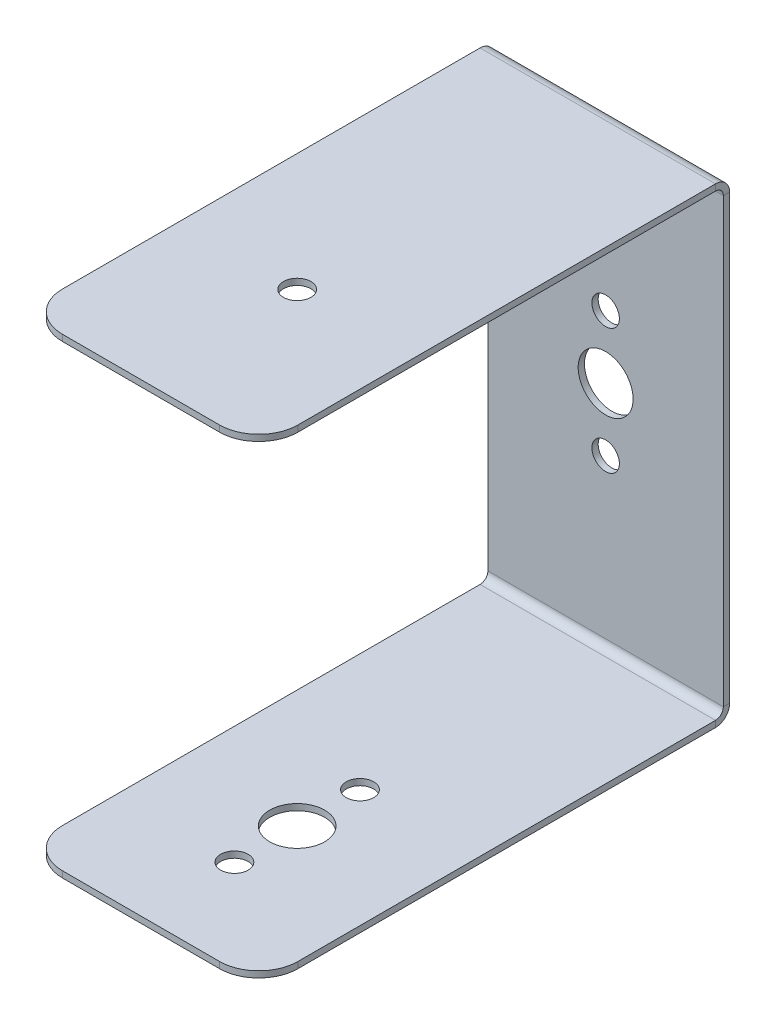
ISO-10303-21;
HEADER;
FILE_DESCRIPTION(('STEP AP214'),'2;1');
FILE_NAME('part.step','',(''),(''),'','','');
FILE_SCHEMA(('AUTOMOTIVE_DESIGN { 1 0 10303 214 1 1 1 1 }'));
ENDSEC;
DATA;
#1=APPLICATION_CONTEXT('core data for automotive mechanical design processes');
#2=APPLICATION_PROTOCOL_DEFINITION('international standard','automotive_design',2000,#1);
#3=PRODUCT_CONTEXT('',#1,'mechanical');
#4=PRODUCT('Part','Part','',(#3));
#5=PRODUCT_RELATED_PRODUCT_CATEGORY('part','',(#4));
#6=PRODUCT_DEFINITION_FORMATION('','',#4);
#7=PRODUCT_DEFINITION_CONTEXT('part definition',#1,'design');
#8=PRODUCT_DEFINITION('design','',#6,#7);
#9=PRODUCT_DEFINITION_SHAPE('','',#8);
#10=(LENGTH_UNIT() NAMED_UNIT(*) SI_UNIT(.MILLI.,.METRE.));
#11=(NAMED_UNIT(*) PLANE_ANGLE_UNIT() SI_UNIT($,.RADIAN.));
#12=(NAMED_UNIT(*) SI_UNIT($,.STERADIAN.) SOLID_ANGLE_UNIT());
#13=UNCERTAINTY_MEASURE_WITH_UNIT(LENGTH_MEASURE(1.E-05),#10,'distance_accuracy_value','');
#14=(GEOMETRIC_REPRESENTATION_CONTEXT(3) GLOBAL_UNCERTAINTY_ASSIGNED_CONTEXT((#13)) GLOBAL_UNIT_ASSIGNED_CONTEXT((#10,
#11,#12)) REPRESENTATION_CONTEXT('',''));
#15=CARTESIAN_POINT('',(0.,0.,0.));
#16=DIRECTION('',(0.,0.,1.));
#17=DIRECTION('',(1.,0.,0.));
#18=AXIS2_PLACEMENT_3D('',#15,#16,#17);
#19=CARTESIAN_POINT('',(15.,30.,0.8));
#20=DIRECTION('',(-1.,0.,0.));
#21=DIRECTION('',(0.,-1.,0.));
#22=AXIS2_PLACEMENT_3D('',#19,#20,#21);
#23=PLANE('',#22);
#24=DIRECTION('',(0.,0.,-1.));
#25=VECTOR('',#24,1.);
#26=CARTESIAN_POINT('',(15.,-28.2,0.799999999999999));
#27=LINE('',#26,#25);
#28=CARTESIAN_POINT('',(15.,-28.2,0.8));
#29=VERTEX_POINT('',#28);
#30=CARTESIAN_POINT('',(15.,-28.2,0.));
#31=VERTEX_POINT('',#30);
#32=EDGE_CURVE('E251',#29,#31,#27,.T.);
#33=ORIENTED_EDGE('',*,*,#32,.T.);
#34=DIRECTION('',(0.,1.,0.));
#35=VECTOR('',#34,1.);
#36=CARTESIAN_POINT('',(15.,30.,0.));
#37=LINE('',#36,#35);
#38=CARTESIAN_POINT('',(15.,28.2,0.));
#39=VERTEX_POINT('',#38);
#40=EDGE_CURVE('E314',#31,#39,#37,.T.);
#41=ORIENTED_EDGE('',*,*,#40,.T.);
#42=DIRECTION('',(0.,0.,-1.));
#43=VECTOR('',#42,1.);
#44=CARTESIAN_POINT('',(15.,28.2,0.799999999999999));
#45=LINE('',#44,#43);
#46=CARTESIAN_POINT('',(15.,28.2,0.8));
#47=VERTEX_POINT('',#46);
#48=EDGE_CURVE('E306',#47,#39,#45,.T.);
#49=ORIENTED_EDGE('',*,*,#48,.F.);
#50=DIRECTION('',(0.,1.,0.));
#51=VECTOR('',#50,1.);
#52=CARTESIAN_POINT('',(15.,30.,0.8));
#53=LINE('',#52,#51);
#54=EDGE_CURVE('E317',#29,#47,#53,.T.);
#55=ORIENTED_EDGE('',*,*,#54,.F.);
#56=EDGE_LOOP('',(#33,#41,#49,#55));
#57=FACE_BOUND('',#56,.T.);
#58=ADVANCED_FACE('F78',(#57),#23,.F.);
#59=CARTESIAN_POINT('',(-15.,30.,0.8));
#60=DIRECTION('',(1.,0.,0.));
#61=DIRECTION('',(0.,1.,0.));
#62=AXIS2_PLACEMENT_3D('',#59,#60,#61);
#63=PLANE('',#62);
#64=DIRECTION('',(0.,0.,-1.));
#65=VECTOR('',#64,1.);
#66=CARTESIAN_POINT('',(-15.,-28.2,0.799999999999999));
#67=LINE('',#66,#65);
#68=CARTESIAN_POINT('',(-15.,-28.2,0.8));
#69=VERTEX_POINT('',#68);
#70=CARTESIAN_POINT('',(-15.,-28.2,0.));
#71=VERTEX_POINT('',#70);
#72=EDGE_CURVE('E259',#69,#71,#67,.T.);
#73=ORIENTED_EDGE('',*,*,#72,.F.);
#74=DIRECTION('',(0.,-1.,0.));
#75=VECTOR('',#74,1.);
#76=CARTESIAN_POINT('',(-15.,30.,0.8));
#77=LINE('',#76,#75);
#78=CARTESIAN_POINT('',(-15.,28.2,0.8));
#79=VERTEX_POINT('',#78);
#80=EDGE_CURVE('E319',#79,#69,#77,.T.);
#81=ORIENTED_EDGE('',*,*,#80,.F.);
#82=DIRECTION('',(0.,0.,-1.));
#83=VECTOR('',#82,1.);
#84=CARTESIAN_POINT('',(-15.,28.2,0.799999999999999));
#85=LINE('',#84,#83);
#86=CARTESIAN_POINT('',(-15.,28.2,0.));
#87=VERTEX_POINT('',#86);
#88=EDGE_CURVE('E295',#79,#87,#85,.T.);
#89=ORIENTED_EDGE('',*,*,#88,.T.);
#90=DIRECTION('',(0.,-1.,0.));
#91=VECTOR('',#90,1.);
#92=CARTESIAN_POINT('',(-15.,30.,0.));
#93=LINE('',#92,#91);
#94=EDGE_CURVE('E320',#87,#71,#93,.T.);
#95=ORIENTED_EDGE('',*,*,#94,.T.);
#96=EDGE_LOOP('',(#73,#81,#89,#95));
#97=FACE_BOUND('',#96,.T.);
#98=ADVANCED_FACE('F394',(#97),#63,.F.);
#99=CARTESIAN_POINT('',(0.,0.,0.8));
#100=DIRECTION('',(0.,0.,1.));
#101=DIRECTION('',(1.,0.,0.));
#102=AXIS2_PLACEMENT_3D('',#99,#100,#101);
#103=PLANE('',#102);
#104=CARTESIAN_POINT('',(0.,8.,0.8));
#105=DIRECTION('',(0.,0.,1.));
#106=DIRECTION('',(1.,0.,0.));
#107=AXIS2_PLACEMENT_3D('',#104,#105,#106);
#108=CIRCLE('',#107,1.75);
#109=CARTESIAN_POINT('',(1.75,8.,0.8));
#110=VERTEX_POINT('',#109);
#111=EDGE_CURVE('E807',#110,#110,#108,.T.);
#112=ORIENTED_EDGE('',*,*,#111,.F.);
#113=EDGE_LOOP('',(#112));
#114=FACE_BOUND('',#113,.T.);
#115=CARTESIAN_POINT('',(0.,-8.,0.8));
#116=DIRECTION('',(0.,0.,1.));
#117=DIRECTION('',(1.,0.,0.));
#118=AXIS2_PLACEMENT_3D('',#115,#116,#117);
#119=CIRCLE('',#118,1.75);
#120=CARTESIAN_POINT('',(1.75,-8.,0.8));
#121=VERTEX_POINT('',#120);
#122=EDGE_CURVE('E801',#121,#121,#119,.T.);
#123=ORIENTED_EDGE('',*,*,#122,.F.);
#124=EDGE_LOOP('',(#123));
#125=FACE_BOUND('',#124,.T.);
#126=CARTESIAN_POINT('',(0.,0.,0.8));
#127=DIRECTION('',(0.,0.,1.));
#128=DIRECTION('',(1.,0.,0.));
#129=AXIS2_PLACEMENT_3D('',#126,#127,#128);
#130=CIRCLE('',#129,3.5);
#131=CARTESIAN_POINT('',(3.5,0.,0.8));
#132=VERTEX_POINT('',#131);
#133=EDGE_CURVE('E309',#132,#132,#130,.T.);
#134=ORIENTED_EDGE('',*,*,#133,.F.);
#135=EDGE_LOOP('',(#134));
#136=FACE_BOUND('',#135,.T.);
#137=ORIENTED_EDGE('',*,*,#80,.T.);
#138=DIRECTION('',(1.,0.,0.));
#139=VECTOR('',#138,1.);
#140=CARTESIAN_POINT('',(15.,-28.2,0.799999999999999));
#141=LINE('',#140,#139);
#142=EDGE_CURVE('E255',#29,#69,#141,.F.);
#143=ORIENTED_EDGE('',*,*,#142,.F.);
#144=ORIENTED_EDGE('',*,*,#54,.T.);
#145=DIRECTION('',(-1.,0.,0.));
#146=VECTOR('',#145,1.);
#147=CARTESIAN_POINT('',(-15.,28.2,0.799999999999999));
#148=LINE('',#147,#146);
#149=EDGE_CURVE('E301',#79,#47,#148,.F.);
#150=ORIENTED_EDGE('',*,*,#149,.F.);
#151=EDGE_LOOP('',(#137,#143,#144,#150));
#152=FACE_BOUND('',#151,.T.);
#153=ADVANCED_FACE('F391',(#114,#125,#136,#152),#103,.T.);
#154=CARTESIAN_POINT('',(0.,0.,0.));
#155=DIRECTION('',(0.,0.,1.));
#156=DIRECTION('',(1.,0.,0.));
#157=AXIS2_PLACEMENT_3D('',#154,#155,#156);
#158=PLANE('',#157);
#159=CARTESIAN_POINT('',(0.,8.,0.));
#160=DIRECTION('',(0.,0.,1.));
#161=DIRECTION('',(1.,0.,0.));
#162=AXIS2_PLACEMENT_3D('',#159,#160,#161);
#163=CIRCLE('',#162,1.75);
#164=CARTESIAN_POINT('',(1.75,8.,0.));
#165=VERTEX_POINT('',#164);
#166=EDGE_CURVE('E804',#165,#165,#163,.T.);
#167=ORIENTED_EDGE('',*,*,#166,.T.);
#168=EDGE_LOOP('',(#167));
#169=FACE_BOUND('',#168,.T.);
#170=CARTESIAN_POINT('',(0.,-8.,0.));
#171=DIRECTION('',(0.,0.,1.));
#172=DIRECTION('',(1.,0.,0.));
#173=AXIS2_PLACEMENT_3D('',#170,#171,#172);
#174=CIRCLE('',#173,1.75);
#175=CARTESIAN_POINT('',(1.75,-8.,0.));
#176=VERTEX_POINT('',#175);
#177=EDGE_CURVE('E798',#176,#176,#174,.T.);
#178=ORIENTED_EDGE('',*,*,#177,.T.);
#179=EDGE_LOOP('',(#178));
#180=FACE_BOUND('',#179,.T.);
#181=CARTESIAN_POINT('',(0.,0.,0.));
#182=DIRECTION('',(0.,0.,1.));
#183=DIRECTION('',(1.,0.,0.));
#184=AXIS2_PLACEMENT_3D('',#181,#182,#183);
#185=CIRCLE('',#184,3.5);
#186=CARTESIAN_POINT('',(3.5,0.,0.));
#187=VERTEX_POINT('',#186);
#188=EDGE_CURVE('E311',#187,#187,#185,.T.);
#189=ORIENTED_EDGE('',*,*,#188,.T.);
#190=EDGE_LOOP('',(#189));
#191=FACE_BOUND('',#190,.T.);
#192=DIRECTION('',(1.,0.,0.));
#193=VECTOR('',#192,1.);
#194=CARTESIAN_POINT('',(15.,-28.2,0.));
#195=LINE('',#194,#193);
#196=EDGE_CURVE('E202',#31,#71,#195,.F.);
#197=ORIENTED_EDGE('',*,*,#196,.T.);
#198=ORIENTED_EDGE('',*,*,#94,.F.);
#199=DIRECTION('',(-1.,0.,0.));
#200=VECTOR('',#199,1.);
#201=CARTESIAN_POINT('',(-15.,28.2,0.));
#202=LINE('',#201,#200);
#203=EDGE_CURVE('E288',#87,#39,#202,.F.);
#204=ORIENTED_EDGE('',*,*,#203,.T.);
#205=ORIENTED_EDGE('',*,*,#40,.F.);
#206=EDGE_LOOP('',(#197,#198,#204,#205));
#207=FACE_BOUND('',#206,.T.);
#208=ADVANCED_FACE('F545',(#169,#180,#191,#207),#158,.F.);
#209=CARTESIAN_POINT('',(0.,0.,0.));
#210=DIRECTION('',(0.,0.,1.));
#211=DIRECTION('',(1.,0.,0.));
#212=AXIS2_PLACEMENT_3D('',#209,#210,#211);
#213=CYLINDRICAL_SURFACE('',#212,3.5);
#214=ORIENTED_EDGE('',*,*,#188,.F.);
#215=EDGE_LOOP('',(#214));
#216=FACE_BOUND('',#215,.T.);
#217=ORIENTED_EDGE('',*,*,#133,.T.);
#218=EDGE_LOOP('',(#217));
#219=FACE_BOUND('',#218,.T.);
#220=ADVANCED_FACE('F557',(#216,#219),#213,.F.);
#221=CARTESIAN_POINT('',(15.,28.2,1.8));
#222=DIRECTION('',(1.,0.,0.));
#223=DIRECTION('',(0.,0.,-1.));
#224=AXIS2_PLACEMENT_3D('',#221,#222,#223);
#225=PLANE('',#224);
#226=DIRECTION('',(0.,-1.,0.));
#227=VECTOR('',#226,1.);
#228=CARTESIAN_POINT('',(15.,30.,1.79999999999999));
#229=LINE('',#228,#227);
#230=CARTESIAN_POINT('',(15.,29.2,1.8));
#231=VERTEX_POINT('',#230);
#232=CARTESIAN_POINT('',(15.,30.,1.79999999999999));
#233=VERTEX_POINT('',#232);
#234=EDGE_CURVE('E262',#231,#233,#229,.F.);
#235=ORIENTED_EDGE('',*,*,#234,.F.);
#236=CARTESIAN_POINT('',(15.,28.2,1.8));
#237=DIRECTION('',(-1.,0.,0.));
#238=DIRECTION('',(0.,0.,1.));
#239=AXIS2_PLACEMENT_3D('',#236,#237,#238);
#240=CIRCLE('',#239,1.);
#241=EDGE_CURVE('E298',#47,#231,#240,.F.);
#242=ORIENTED_EDGE('',*,*,#241,.F.);
#243=ORIENTED_EDGE('',*,*,#48,.T.);
#244=CARTESIAN_POINT('',(15.,28.2,1.8));
#245=DIRECTION('',(-1.,0.,0.));
#246=DIRECTION('',(0.,0.,1.));
#247=AXIS2_PLACEMENT_3D('',#244,#245,#246);
#248=CIRCLE('',#247,1.8);
#249=EDGE_CURVE('E291',#39,#233,#248,.F.);
#250=ORIENTED_EDGE('',*,*,#249,.T.);
#251=EDGE_LOOP('',(#235,#242,#243,#250));
#252=FACE_BOUND('',#251,.T.);
#253=ADVANCED_FACE('F380',(#252),#225,.T.);
#254=CARTESIAN_POINT('',(-15.,28.2,1.8));
#255=DIRECTION('',(1.,0.,0.));
#256=DIRECTION('',(0.,0.,-1.));
#257=AXIS2_PLACEMENT_3D('',#254,#255,#256);
#258=PLANE('',#257);
#259=CARTESIAN_POINT('',(-15.,28.2,1.8));
#260=DIRECTION('',(-1.,0.,0.));
#261=DIRECTION('',(0.,0.,1.));
#262=AXIS2_PLACEMENT_3D('',#259,#260,#261);
#263=CIRCLE('',#262,1.);
#264=CARTESIAN_POINT('',(-15.,29.2,1.8));
#265=VERTEX_POINT('',#264);
#266=EDGE_CURVE('E266',#265,#79,#263,.T.);
#267=ORIENTED_EDGE('',*,*,#266,.F.);
#268=DIRECTION('',(0.,-1.,0.));
#269=VECTOR('',#268,1.);
#270=CARTESIAN_POINT('',(-15.,29.2,1.8));
#271=LINE('',#270,#269);
#272=CARTESIAN_POINT('',(-15.,30.,1.79999999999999));
#273=VERTEX_POINT('',#272);
#274=EDGE_CURVE('E281',#265,#273,#271,.F.);
#275=ORIENTED_EDGE('',*,*,#274,.T.);
#276=CARTESIAN_POINT('',(-15.,28.2,1.8));
#277=DIRECTION('',(-1.,0.,0.));
#278=DIRECTION('',(0.,0.,1.));
#279=AXIS2_PLACEMENT_3D('',#276,#277,#278);
#280=CIRCLE('',#279,1.8);
#281=EDGE_CURVE('E292',#273,#87,#280,.T.);
#282=ORIENTED_EDGE('',*,*,#281,.T.);
#283=ORIENTED_EDGE('',*,*,#88,.F.);
#284=EDGE_LOOP('',(#267,#275,#282,#283));
#285=FACE_BOUND('',#284,.T.);
#286=ADVANCED_FACE('F372',(#285),#258,.F.);
#287=CARTESIAN_POINT('',(-15.,28.2,1.8));
#288=DIRECTION('',(-1.,0.,0.));
#289=DIRECTION('',(0.,1.,0.));
#290=AXIS2_PLACEMENT_3D('',#287,#288,#289);
#291=CYLINDRICAL_SURFACE('',#290,1.8);
#292=ORIENTED_EDGE('',*,*,#203,.F.);
#293=ORIENTED_EDGE('',*,*,#281,.F.);
#294=DIRECTION('',(-1.,0.,0.));
#295=VECTOR('',#294,1.);
#296=CARTESIAN_POINT('',(15.,30.,1.79999999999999));
#297=LINE('',#296,#295);
#298=EDGE_CURVE('E278',#273,#233,#297,.F.);
#299=ORIENTED_EDGE('',*,*,#298,.T.);
#300=ORIENTED_EDGE('',*,*,#249,.F.);
#301=EDGE_LOOP('',(#292,#293,#299,#300));
#302=FACE_BOUND('',#301,.T.);
#303=ADVANCED_FACE('F377',(#302),#291,.T.);
#304=CARTESIAN_POINT('',(-15.,28.2,1.8));
#305=DIRECTION('',(-1.,0.,0.));
#306=DIRECTION('',(0.,1.,0.));
#307=AXIS2_PLACEMENT_3D('',#304,#305,#306);
#308=CYLINDRICAL_SURFACE('',#307,1.);
#309=ORIENTED_EDGE('',*,*,#149,.T.);
#310=ORIENTED_EDGE('',*,*,#241,.T.);
#311=DIRECTION('',(-1.,0.,0.));
#312=VECTOR('',#311,1.);
#313=CARTESIAN_POINT('',(15.,29.2,1.8));
#314=LINE('',#313,#312);
#315=EDGE_CURVE('E284',#231,#265,#314,.T.);
#316=ORIENTED_EDGE('',*,*,#315,.T.);
#317=ORIENTED_EDGE('',*,*,#266,.T.);
#318=EDGE_LOOP('',(#309,#310,#316,#317));
#319=FACE_BOUND('',#318,.T.);
#320=ADVANCED_FACE('F388',(#319),#308,.F.);
#321=CARTESIAN_POINT('',(15.,30.,0.799999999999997));
#322=DIRECTION('',(-1.,0.,0.));
#323=DIRECTION('',(0.,0.,1.));
#324=AXIS2_PLACEMENT_3D('',#321,#322,#323);
#325=PLANE('',#324);
#326=DIRECTION('',(0.,0.,-1.));
#327=VECTOR('',#326,1.);
#328=CARTESIAN_POINT('',(15.,30.,-1.08283126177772E-13));
#329=LINE('',#328,#327);
#330=CARTESIAN_POINT('',(15.,30.0000000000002,55.));
#331=VERTEX_POINT('',#330);
#332=EDGE_CURVE('E269',#331,#233,#329,.T.);
#333=ORIENTED_EDGE('',*,*,#332,.F.);
#334=DIRECTION('',(0.,-1.,0.));
#335=VECTOR('',#334,1.);
#336=CARTESIAN_POINT('',(15.,30.0000000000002,55.));
#337=LINE('',#336,#335);
#338=CARTESIAN_POINT('',(15.,29.2000000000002,55.));
#339=VERTEX_POINT('',#338);
#340=EDGE_CURVE('E13',#331,#339,#337,.T.);
#341=ORIENTED_EDGE('',*,*,#340,.T.);
#342=DIRECTION('',(0.,0.,1.));
#343=VECTOR('',#342,1.);
#344=CARTESIAN_POINT('',(15.,29.2,0.8));
#345=LINE('',#344,#343);
#346=EDGE_CURVE('E276',#339,#231,#345,.F.);
#347=ORIENTED_EDGE('',*,*,#346,.T.);
#348=ORIENTED_EDGE('',*,*,#234,.T.);
#349=EDGE_LOOP('',(#333,#341,#347,#348));
#350=FACE_BOUND('',#349,.T.);
#351=ADVANCED_FACE('F384',(#350),#325,.F.);
#352=CARTESIAN_POINT('',(-15.,30.0000000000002,60.));
#353=DIRECTION('',(1.,0.,0.));
#354=DIRECTION('',(0.,0.,-1.));
#355=AXIS2_PLACEMENT_3D('',#352,#353,#354);
#356=PLANE('',#355);
#357=DIRECTION('',(0.,0.,-1.));
#358=VECTOR('',#357,1.);
#359=CARTESIAN_POINT('',(-15.,29.2000000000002,60.));
#360=LINE('',#359,#358);
#361=CARTESIAN_POINT('',(-15.,29.2000000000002,55.));
#362=VERTEX_POINT('',#361);
#363=EDGE_CURVE('E274',#265,#362,#360,.F.);
#364=ORIENTED_EDGE('',*,*,#363,.T.);
#365=DIRECTION('',(0.,-1.,0.));
#366=VECTOR('',#365,1.);
#367=CARTESIAN_POINT('',(-15.,30.0000000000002,55.));
#368=LINE('',#367,#366);
#369=CARTESIAN_POINT('',(-15.,30.0000000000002,55.));
#370=VERTEX_POINT('',#369);
#371=EDGE_CURVE('E101',#362,#370,#368,.F.);
#372=ORIENTED_EDGE('',*,*,#371,.T.);
#373=DIRECTION('',(0.,0.,1.));
#374=VECTOR('',#373,1.);
#375=CARTESIAN_POINT('',(-15.,30.,-1.06524960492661E-13));
#376=LINE('',#375,#374);
#377=EDGE_CURVE('E267',#273,#370,#376,.T.);
#378=ORIENTED_EDGE('',*,*,#377,.F.);
#379=ORIENTED_EDGE('',*,*,#274,.F.);
#380=EDGE_LOOP('',(#364,#372,#378,#379));
#381=FACE_BOUND('',#380,.T.);
#382=ADVANCED_FACE('F369',(#381),#356,.F.);
#383=CARTESIAN_POINT('',(0.,30.,-1.08283126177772E-13));
#384=DIRECTION('',(0.,-1.,0.));
#385=DIRECTION('',(0.,0.,-1.));
#386=AXIS2_PLACEMENT_3D('',#383,#384,#385);
#387=PLANE('',#386);
#388=CARTESIAN_POINT('',(0.,30.0000000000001,40.1));
#389=DIRECTION('',(0.,1.,0.));
#390=DIRECTION('',(0.,0.,1.));
#391=AXIS2_PLACEMENT_3D('',#388,#389,#390);
#392=CIRCLE('',#391,1.75);
#393=CARTESIAN_POINT('',(0.,30.0000000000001,41.85));
#394=VERTEX_POINT('',#393);
#395=EDGE_CURVE('E772',#394,#394,#392,.T.);
#396=ORIENTED_EDGE('',*,*,#395,.F.);
#397=EDGE_LOOP('',(#396));
#398=FACE_BOUND('',#397,.T.);
#399=ORIENTED_EDGE('',*,*,#377,.T.);
#400=CARTESIAN_POINT('',(-10.,30.0000000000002,55.));
#401=DIRECTION('',(0.,-1.,0.));
#402=DIRECTION('',(0.,0.,-1.));
#403=AXIS2_PLACEMENT_3D('',#400,#401,#402);
#404=CIRCLE('',#403,5.);
#405=CARTESIAN_POINT('',(-10.,30.0000000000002,60.));
#406=VERTEX_POINT('',#405);
#407=EDGE_CURVE('E86',#370,#406,#404,.F.);
#408=ORIENTED_EDGE('',*,*,#407,.T.);
#409=DIRECTION('',(1.,0.,0.));
#410=VECTOR('',#409,1.);
#411=CARTESIAN_POINT('',(0.,30.0000000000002,60.));
#412=LINE('',#411,#410);
#413=CARTESIAN_POINT('',(9.99999999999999,30.0000000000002,60.));
#414=VERTEX_POINT('',#413);
#415=EDGE_CURVE('E264',#406,#414,#412,.T.);
#416=ORIENTED_EDGE('',*,*,#415,.T.);
#417=CARTESIAN_POINT('',(9.99999999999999,30.0000000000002,55.));
#418=DIRECTION('',(0.,-1.,0.));
#419=DIRECTION('',(0.,0.,-1.));
#420=AXIS2_PLACEMENT_3D('',#417,#418,#419);
#421=CIRCLE('',#420,5.);
#422=EDGE_CURVE('E93',#414,#331,#421,.F.);
#423=ORIENTED_EDGE('',*,*,#422,.T.);
#424=ORIENTED_EDGE('',*,*,#332,.T.);
#425=ORIENTED_EDGE('',*,*,#298,.F.);
#426=EDGE_LOOP('',(#399,#408,#416,#423,#424,#425));
#427=FACE_BOUND('',#426,.T.);
#428=ADVANCED_FACE('F355',(#398,#427),#387,.F.);
#429=CARTESIAN_POINT('',(0.,29.2,-1.05489941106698E-13));
#430=DIRECTION('',(0.,-1.,0.));
#431=DIRECTION('',(0.,0.,-1.));
#432=AXIS2_PLACEMENT_3D('',#429,#430,#431);
#433=PLANE('',#432);
#434=CARTESIAN_POINT('',(0.,29.2000000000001,40.1));
#435=DIRECTION('',(0.,1.,0.));
#436=DIRECTION('',(0.,0.,1.));
#437=AXIS2_PLACEMENT_3D('',#434,#435,#436);
#438=CIRCLE('',#437,1.75);
#439=CARTESIAN_POINT('',(0.,29.2000000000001,41.85));
#440=VERTEX_POINT('',#439);
#441=EDGE_CURVE('E774',#440,#440,#438,.T.);
#442=ORIENTED_EDGE('',*,*,#441,.T.);
#443=EDGE_LOOP('',(#442));
#444=FACE_BOUND('',#443,.T.);
#445=DIRECTION('',(-1.,0.,0.));
#446=VECTOR('',#445,1.);
#447=CARTESIAN_POINT('',(15.,29.2000000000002,60.));
#448=LINE('',#447,#446);
#449=CARTESIAN_POINT('',(-10.,29.2000000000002,60.));
#450=VERTEX_POINT('',#449);
#451=CARTESIAN_POINT('',(9.99999999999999,29.2000000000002,60.));
#452=VERTEX_POINT('',#451);
#453=EDGE_CURVE('E271',#450,#452,#448,.F.);
#454=ORIENTED_EDGE('',*,*,#453,.F.);
#455=CARTESIAN_POINT('',(-10.,29.2000000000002,55.));
#456=DIRECTION('',(0.,-1.,0.));
#457=DIRECTION('',(0.,0.,-1.));
#458=AXIS2_PLACEMENT_3D('',#455,#456,#457);
#459=CIRCLE('',#458,5.);
#460=EDGE_CURVE('E350',#450,#362,#459,.T.);
#461=ORIENTED_EDGE('',*,*,#460,.T.);
#462=ORIENTED_EDGE('',*,*,#363,.F.);
#463=ORIENTED_EDGE('',*,*,#315,.F.);
#464=ORIENTED_EDGE('',*,*,#346,.F.);
#465=CARTESIAN_POINT('',(9.99999999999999,29.2000000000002,55.));
#466=DIRECTION('',(0.,-1.,0.));
#467=DIRECTION('',(0.,0.,-1.));
#468=AXIS2_PLACEMENT_3D('',#465,#466,#467);
#469=CIRCLE('',#468,5.);
#470=EDGE_CURVE('E348',#339,#452,#469,.T.);
#471=ORIENTED_EDGE('',*,*,#470,.T.);
#472=EDGE_LOOP('',(#454,#461,#462,#463,#464,#471));
#473=FACE_BOUND('',#472,.T.);
#474=ADVANCED_FACE('F366',(#444,#473),#433,.T.);
#475=CARTESIAN_POINT('',(15.,30.0000000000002,60.));
#476=DIRECTION('',(0.,0.,-1.));
#477=DIRECTION('',(0.,1.,0.));
#478=AXIS2_PLACEMENT_3D('',#475,#476,#477);
#479=PLANE('',#478);
#480=ORIENTED_EDGE('',*,*,#415,.F.);
#481=DIRECTION('',(0.,-1.,0.));
#482=VECTOR('',#481,1.);
#483=CARTESIAN_POINT('',(-10.,30.0000000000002,60.));
#484=LINE('',#483,#482);
#485=EDGE_CURVE('E345',#406,#450,#484,.T.);
#486=ORIENTED_EDGE('',*,*,#485,.T.);
#487=ORIENTED_EDGE('',*,*,#453,.T.);
#488=DIRECTION('',(0.,-1.,0.));
#489=VECTOR('',#488,1.);
#490=CARTESIAN_POINT('',(9.99999999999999,30.0000000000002,60.));
#491=LINE('',#490,#489);
#492=EDGE_CURVE('E343',#452,#414,#491,.F.);
#493=ORIENTED_EDGE('',*,*,#492,.T.);
#494=EDGE_LOOP('',(#480,#486,#487,#493));
#495=FACE_BOUND('',#494,.T.);
#496=ADVANCED_FACE('F360',(#495),#479,.F.);
#497=CARTESIAN_POINT('',(-15.,-28.2,1.8));
#498=DIRECTION('',(-1.,0.,0.));
#499=DIRECTION('',(0.,0.,1.));
#500=AXIS2_PLACEMENT_3D('',#497,#498,#499);
#501=PLANE('',#500);
#502=DIRECTION('',(0.,1.,0.));
#503=VECTOR('',#502,1.);
#504=CARTESIAN_POINT('',(-15.,-30.,1.79999999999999));
#505=LINE('',#504,#503);
#506=CARTESIAN_POINT('',(-15.,-29.2,1.8));
#507=VERTEX_POINT('',#506);
#508=CARTESIAN_POINT('',(-15.,-30.,1.79999999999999));
#509=VERTEX_POINT('',#508);
#510=EDGE_CURVE('E245',#507,#509,#505,.F.);
#511=ORIENTED_EDGE('',*,*,#510,.F.);
#512=CARTESIAN_POINT('',(-15.,-28.2,1.8));
#513=DIRECTION('',(1.,0.,0.));
#514=DIRECTION('',(0.,0.,-1.));
#515=AXIS2_PLACEMENT_3D('',#512,#513,#514);
#516=CIRCLE('',#515,1.);
#517=EDGE_CURVE('E205',#69,#507,#516,.F.);
#518=ORIENTED_EDGE('',*,*,#517,.F.);
#519=ORIENTED_EDGE('',*,*,#72,.T.);
#520=CARTESIAN_POINT('',(-15.,-28.2,1.8));
#521=DIRECTION('',(1.,0.,0.));
#522=DIRECTION('',(0.,0.,-1.));
#523=AXIS2_PLACEMENT_3D('',#520,#521,#522);
#524=CIRCLE('',#523,1.8);
#525=EDGE_CURVE('E250',#71,#509,#524,.F.);
#526=ORIENTED_EDGE('',*,*,#525,.T.);
#527=EDGE_LOOP('',(#511,#518,#519,#526));
#528=FACE_BOUND('',#527,.T.);
#529=ADVANCED_FACE('F399',(#528),#501,.T.);
#530=CARTESIAN_POINT('',(15.,-28.2,1.8));
#531=DIRECTION('',(-1.,0.,0.));
#532=DIRECTION('',(0.,0.,1.));
#533=AXIS2_PLACEMENT_3D('',#530,#531,#532);
#534=PLANE('',#533);
#535=CARTESIAN_POINT('',(15.,-28.2,1.8));
#536=DIRECTION('',(1.,0.,0.));
#537=DIRECTION('',(0.,0.,-1.));
#538=AXIS2_PLACEMENT_3D('',#535,#536,#537);
#539=CIRCLE('',#538,1.);
#540=CARTESIAN_POINT('',(15.,-29.2,1.8));
#541=VERTEX_POINT('',#540);
#542=EDGE_CURVE('E212',#541,#29,#539,.T.);
#543=ORIENTED_EDGE('',*,*,#542,.F.);
#544=DIRECTION('',(0.,1.,0.));
#545=VECTOR('',#544,1.);
#546=CARTESIAN_POINT('',(15.,-29.2,1.8));
#547=LINE('',#546,#545);
#548=CARTESIAN_POINT('',(15.,-30.,1.79999999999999));
#549=VERTEX_POINT('',#548);
#550=EDGE_CURVE('E209',#541,#549,#547,.F.);
#551=ORIENTED_EDGE('',*,*,#550,.T.);
#552=CARTESIAN_POINT('',(15.,-28.2,1.8));
#553=DIRECTION('',(1.,0.,0.));
#554=DIRECTION('',(0.,0.,-1.));
#555=AXIS2_PLACEMENT_3D('',#552,#553,#554);
#556=CIRCLE('',#555,1.8);
#557=EDGE_CURVE('E195',#549,#31,#556,.T.);
#558=ORIENTED_EDGE('',*,*,#557,.T.);
#559=ORIENTED_EDGE('',*,*,#32,.F.);
#560=EDGE_LOOP('',(#543,#551,#558,#559));
#561=FACE_BOUND('',#560,.T.);
#562=ADVANCED_FACE('F210',(#561),#534,.F.);
#563=CARTESIAN_POINT('',(15.,-28.2,1.8));
#564=DIRECTION('',(1.,0.,0.));
#565=DIRECTION('',(0.,-1.,0.));
#566=AXIS2_PLACEMENT_3D('',#563,#564,#565);
#567=CYLINDRICAL_SURFACE('',#566,1.8);
#568=ORIENTED_EDGE('',*,*,#196,.F.);
#569=ORIENTED_EDGE('',*,*,#557,.F.);
#570=DIRECTION('',(1.,0.,0.));
#571=VECTOR('',#570,1.);
#572=CARTESIAN_POINT('',(-15.,-30.,1.79999999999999));
#573=LINE('',#572,#571);
#574=EDGE_CURVE('E200',#549,#509,#573,.F.);
#575=ORIENTED_EDGE('',*,*,#574,.T.);
#576=ORIENTED_EDGE('',*,*,#525,.F.);
#577=EDGE_LOOP('',(#568,#569,#575,#576));
#578=FACE_BOUND('',#577,.T.);
#579=ADVANCED_FACE('F197',(#578),#567,.T.);
#580=CARTESIAN_POINT('',(15.,-28.2,1.8));
#581=DIRECTION('',(1.,0.,0.));
#582=DIRECTION('',(0.,-1.,0.));
#583=AXIS2_PLACEMENT_3D('',#580,#581,#582);
#584=CYLINDRICAL_SURFACE('',#583,1.);
#585=ORIENTED_EDGE('',*,*,#142,.T.);
#586=ORIENTED_EDGE('',*,*,#517,.T.);
#587=DIRECTION('',(1.,0.,0.));
#588=VECTOR('',#587,1.);
#589=CARTESIAN_POINT('',(-15.,-29.2,1.8));
#590=LINE('',#589,#588);
#591=EDGE_CURVE('E217',#507,#541,#590,.T.);
#592=ORIENTED_EDGE('',*,*,#591,.T.);
#593=ORIENTED_EDGE('',*,*,#542,.T.);
#594=EDGE_LOOP('',(#585,#586,#592,#593));
#595=FACE_BOUND('',#594,.T.);
#596=ADVANCED_FACE('F402',(#595),#584,.F.);
#597=CARTESIAN_POINT('',(-15.,-30.,0.799999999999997));
#598=DIRECTION('',(1.,0.,0.));
#599=DIRECTION('',(0.,0.,-1.));
#600=AXIS2_PLACEMENT_3D('',#597,#598,#599);
#601=PLANE('',#600);
#602=DIRECTION('',(0.,0.,-1.));
#603=VECTOR('',#602,1.);
#604=CARTESIAN_POINT('',(-15.,-30.,-1.08283126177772E-13));
#605=LINE('',#604,#603);
#606=CARTESIAN_POINT('',(-15.,-30.0000000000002,55.));
#607=VERTEX_POINT('',#606);
#608=EDGE_CURVE('E226',#607,#509,#605,.T.);
#609=ORIENTED_EDGE('',*,*,#608,.F.);
#610=DIRECTION('',(0.,1.,0.));
#611=VECTOR('',#610,1.);
#612=CARTESIAN_POINT('',(-15.,-30.0000000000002,55.));
#613=LINE('',#612,#611);
#614=CARTESIAN_POINT('',(-15.,-29.2000000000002,55.));
#615=VERTEX_POINT('',#614);
#616=EDGE_CURVE('E323',#607,#615,#613,.T.);
#617=ORIENTED_EDGE('',*,*,#616,.T.);
#618=DIRECTION('',(0.,0.,1.));
#619=VECTOR('',#618,1.);
#620=CARTESIAN_POINT('',(-15.,-29.2,0.8));
#621=LINE('',#620,#619);
#622=EDGE_CURVE('E227',#615,#507,#621,.F.);
#623=ORIENTED_EDGE('',*,*,#622,.T.);
#624=ORIENTED_EDGE('',*,*,#510,.T.);
#625=EDGE_LOOP('',(#609,#617,#623,#624));
#626=FACE_BOUND('',#625,.T.);
#627=ADVANCED_FACE('F419',(#626),#601,.F.);
#628=CARTESIAN_POINT('',(15.,-30.0000000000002,60.));
#629=DIRECTION('',(-1.,0.,0.));
#630=DIRECTION('',(0.,0.,1.));
#631=AXIS2_PLACEMENT_3D('',#628,#629,#630);
#632=PLANE('',#631);
#633=DIRECTION('',(0.,0.,-1.));
#634=VECTOR('',#633,1.);
#635=CARTESIAN_POINT('',(15.,-29.2000000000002,60.));
#636=LINE('',#635,#634);
#637=CARTESIAN_POINT('',(15.,-29.2000000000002,55.));
#638=VERTEX_POINT('',#637);
#639=EDGE_CURVE('E241',#541,#638,#636,.F.);
#640=ORIENTED_EDGE('',*,*,#639,.T.);
#641=DIRECTION('',(0.,1.,0.));
#642=VECTOR('',#641,1.);
#643=CARTESIAN_POINT('',(15.,-30.0000000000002,55.));
#644=LINE('',#643,#642);
#645=CARTESIAN_POINT('',(15.,-30.0000000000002,55.));
#646=VERTEX_POINT('',#645);
#647=EDGE_CURVE('E231',#638,#646,#644,.F.);
#648=ORIENTED_EDGE('',*,*,#647,.T.);
#649=DIRECTION('',(0.,0.,1.));
#650=VECTOR('',#649,1.);
#651=CARTESIAN_POINT('',(15.,-30.,-1.06524960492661E-13));
#652=LINE('',#651,#650);
#653=EDGE_CURVE('E223',#549,#646,#652,.T.);
#654=ORIENTED_EDGE('',*,*,#653,.F.);
#655=ORIENTED_EDGE('',*,*,#550,.F.);
#656=EDGE_LOOP('',(#640,#648,#654,#655));
#657=FACE_BOUND('',#656,.T.);
#658=ADVANCED_FACE('F229',(#657),#632,.F.);
#659=CARTESIAN_POINT('',(0.,-30.,-1.08283126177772E-13));
#660=DIRECTION('',(0.,1.,0.));
#661=DIRECTION('',(0.,0.,1.));
#662=AXIS2_PLACEMENT_3D('',#659,#660,#661);
#663=PLANE('',#662);
#664=CARTESIAN_POINT('',(0.,-30.0000000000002,48.1));
#665=DIRECTION('',(0.,-1.,0.));
#666=DIRECTION('',(0.,0.,-1.));
#667=AXIS2_PLACEMENT_3D('',#664,#665,#666);
#668=CIRCLE('',#667,1.75);
#669=CARTESIAN_POINT('',(0.,-30.0000000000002,46.35));
#670=VERTEX_POINT('',#669);
#671=EDGE_CURVE('E795',#670,#670,#668,.T.);
#672=ORIENTED_EDGE('',*,*,#671,.F.);
#673=EDGE_LOOP('',(#672));
#674=FACE_BOUND('',#673,.T.);
#675=CARTESIAN_POINT('',(0.,-30.0000000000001,32.1));
#676=DIRECTION('',(0.,-1.,0.));
#677=DIRECTION('',(0.,0.,-1.));
#678=AXIS2_PLACEMENT_3D('',#675,#676,#677);
#679=CIRCLE('',#678,1.75);
#680=CARTESIAN_POINT('',(0.,-30.0000000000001,30.35));
#681=VERTEX_POINT('',#680);
#682=EDGE_CURVE('E781',#681,#681,#679,.T.);
#683=ORIENTED_EDGE('',*,*,#682,.F.);
#684=EDGE_LOOP('',(#683));
#685=FACE_BOUND('',#684,.T.);
#686=CARTESIAN_POINT('',(0.,-30.0000000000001,40.1));
#687=DIRECTION('',(0.,-1.,0.));
#688=DIRECTION('',(0.,0.,-1.));
#689=AXIS2_PLACEMENT_3D('',#686,#687,#688);
#690=CIRCLE('',#689,3.5);
#691=CARTESIAN_POINT('',(0.,-30.0000000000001,36.6));
#692=VERTEX_POINT('',#691);
#693=EDGE_CURVE('E778',#692,#692,#690,.T.);
#694=ORIENTED_EDGE('',*,*,#693,.F.);
#695=EDGE_LOOP('',(#694));
#696=FACE_BOUND('',#695,.T.);
#697=DIRECTION('',(-1.,0.,0.));
#698=VECTOR('',#697,1.);
#699=CARTESIAN_POINT('',(0.,-30.0000000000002,60.));
#700=LINE('',#699,#698);
#701=CARTESIAN_POINT('',(9.99999999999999,-30.0000000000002,60.));
#702=VERTEX_POINT('',#701);
#703=CARTESIAN_POINT('',(-10.,-30.0000000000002,60.));
#704=VERTEX_POINT('',#703);
#705=EDGE_CURVE('E232',#702,#704,#700,.T.);
#706=ORIENTED_EDGE('',*,*,#705,.T.);
#707=CARTESIAN_POINT('',(-10.,-30.0000000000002,55.));
#708=DIRECTION('',(0.,1.,0.));
#709=DIRECTION('',(0.,0.,1.));
#710=AXIS2_PLACEMENT_3D('',#707,#708,#709);
#711=CIRCLE('',#710,5.);
#712=EDGE_CURVE('E340',#704,#607,#711,.F.);
#713=ORIENTED_EDGE('',*,*,#712,.T.);
#714=ORIENTED_EDGE('',*,*,#608,.T.);
#715=ORIENTED_EDGE('',*,*,#574,.F.);
#716=ORIENTED_EDGE('',*,*,#653,.T.);
#717=CARTESIAN_POINT('',(9.99999999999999,-30.0000000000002,55.));
#718=DIRECTION('',(0.,1.,0.));
#719=DIRECTION('',(0.,0.,1.));
#720=AXIS2_PLACEMENT_3D('',#717,#718,#719);
#721=CIRCLE('',#720,5.);
#722=EDGE_CURVE('E338',#646,#702,#721,.F.);
#723=ORIENTED_EDGE('',*,*,#722,.T.);
#724=EDGE_LOOP('',(#706,#713,#714,#715,#716,#723));
#725=FACE_BOUND('',#724,.T.);
#726=ADVANCED_FACE('F222',(#674,#685,#696,#725),#663,.F.);
#727=CARTESIAN_POINT('',(0.,-29.2,-1.05489941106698E-13));
#728=DIRECTION('',(0.,1.,0.));
#729=DIRECTION('',(0.,0.,1.));
#730=AXIS2_PLACEMENT_3D('',#727,#728,#729);
#731=PLANE('',#730);
#732=CARTESIAN_POINT('',(0.,-29.2000000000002,48.1));
#733=DIRECTION('',(0.,-1.,0.));
#734=DIRECTION('',(0.,0.,-1.));
#735=AXIS2_PLACEMENT_3D('',#732,#733,#734);
#736=CIRCLE('',#735,1.75);
#737=CARTESIAN_POINT('',(0.,-29.2000000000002,46.35));
#738=VERTEX_POINT('',#737);
#739=EDGE_CURVE('E793',#738,#738,#736,.T.);
#740=ORIENTED_EDGE('',*,*,#739,.T.);
#741=EDGE_LOOP('',(#740));
#742=FACE_BOUND('',#741,.T.);
#743=CARTESIAN_POINT('',(0.,-29.2000000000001,32.1));
#744=DIRECTION('',(0.,-1.,0.));
#745=DIRECTION('',(0.,0.,-1.));
#746=AXIS2_PLACEMENT_3D('',#743,#744,#745);
#747=CIRCLE('',#746,1.75);
#748=CARTESIAN_POINT('',(0.,-29.2000000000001,30.35));
#749=VERTEX_POINT('',#748);
#750=EDGE_CURVE('E775',#749,#749,#747,.T.);
#751=ORIENTED_EDGE('',*,*,#750,.T.);
#752=EDGE_LOOP('',(#751));
#753=FACE_BOUND('',#752,.T.);
#754=CARTESIAN_POINT('',(0.,-29.2000000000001,40.1));
#755=DIRECTION('',(0.,-1.,0.));
#756=DIRECTION('',(0.,0.,-1.));
#757=AXIS2_PLACEMENT_3D('',#754,#755,#756);
#758=CIRCLE('',#757,3.5);
#759=CARTESIAN_POINT('',(0.,-29.2000000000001,36.6));
#760=VERTEX_POINT('',#759);
#761=EDGE_CURVE('E248',#760,#760,#758,.T.);
#762=ORIENTED_EDGE('',*,*,#761,.T.);
#763=EDGE_LOOP('',(#762));
#764=FACE_BOUND('',#763,.T.);
#765=ORIENTED_EDGE('',*,*,#622,.F.);
#766=CARTESIAN_POINT('',(-10.,-29.2000000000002,55.));
#767=DIRECTION('',(0.,1.,0.));
#768=DIRECTION('',(0.,0.,1.));
#769=AXIS2_PLACEMENT_3D('',#766,#767,#768);
#770=CIRCLE('',#769,5.);
#771=CARTESIAN_POINT('',(-10.,-29.2000000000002,60.));
#772=VERTEX_POINT('',#771);
#773=EDGE_CURVE('E331',#615,#772,#770,.T.);
#774=ORIENTED_EDGE('',*,*,#773,.T.);
#775=DIRECTION('',(1.,0.,0.));
#776=VECTOR('',#775,1.);
#777=CARTESIAN_POINT('',(-15.,-29.2000000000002,60.));
#778=LINE('',#777,#776);
#779=CARTESIAN_POINT('',(9.99999999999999,-29.2000000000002,60.));
#780=VERTEX_POINT('',#779);
#781=EDGE_CURVE('E235',#780,#772,#778,.F.);
#782=ORIENTED_EDGE('',*,*,#781,.F.);
#783=CARTESIAN_POINT('',(9.99999999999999,-29.2000000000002,55.));
#784=DIRECTION('',(0.,1.,0.));
#785=DIRECTION('',(0.,0.,1.));
#786=AXIS2_PLACEMENT_3D('',#783,#784,#785);
#787=CIRCLE('',#786,5.);
#788=EDGE_CURVE('E329',#780,#638,#787,.T.);
#789=ORIENTED_EDGE('',*,*,#788,.T.);
#790=ORIENTED_EDGE('',*,*,#639,.F.);
#791=ORIENTED_EDGE('',*,*,#591,.F.);
#792=EDGE_LOOP('',(#765,#774,#782,#789,#790,#791));
#793=FACE_BOUND('',#792,.T.);
#794=ADVANCED_FACE('F405',(#742,#753,#764,#793),#731,.T.);
#795=CARTESIAN_POINT('',(-15.,-30.0000000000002,60.));
#796=DIRECTION('',(0.,0.,-1.));
#797=DIRECTION('',(0.,1.,0.));
#798=AXIS2_PLACEMENT_3D('',#795,#796,#797);
#799=PLANE('',#798);
#800=ORIENTED_EDGE('',*,*,#781,.T.);
#801=DIRECTION('',(0.,1.,0.));
#802=VECTOR('',#801,1.);
#803=CARTESIAN_POINT('',(-10.,-30.0000000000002,60.));
#804=LINE('',#803,#802);
#805=EDGE_CURVE('E336',#772,#704,#804,.F.);
#806=ORIENTED_EDGE('',*,*,#805,.T.);
#807=ORIENTED_EDGE('',*,*,#705,.F.);
#808=DIRECTION('',(0.,1.,0.));
#809=VECTOR('',#808,1.);
#810=CARTESIAN_POINT('',(9.99999999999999,-30.0000000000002,60.));
#811=LINE('',#810,#809);
#812=EDGE_CURVE('E333',#702,#780,#811,.T.);
#813=ORIENTED_EDGE('',*,*,#812,.T.);
#814=EDGE_LOOP('',(#800,#806,#807,#813));
#815=FACE_BOUND('',#814,.T.);
#816=ADVANCED_FACE('F413',(#815),#799,.F.);
#817=CARTESIAN_POINT('',(0.,-29.2000000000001,40.1));
#818=DIRECTION('',(0.,-1.,0.));
#819=DIRECTION('',(0.,0.,-1.));
#820=AXIS2_PLACEMENT_3D('',#817,#818,#819);
#821=CYLINDRICAL_SURFACE('',#820,3.5);
#822=ORIENTED_EDGE('',*,*,#761,.F.);
#823=EDGE_LOOP('',(#822));
#824=FACE_BOUND('',#823,.T.);
#825=ORIENTED_EDGE('',*,*,#693,.T.);
#826=EDGE_LOOP('',(#825));
#827=FACE_BOUND('',#826,.T.);
#828=ADVANCED_FACE('F466',(#824,#827),#821,.F.);
#829=CARTESIAN_POINT('',(0.,29.2000000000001,40.1));
#830=DIRECTION('',(0.,1.,0.));
#831=DIRECTION('',(0.,0.,1.));
#832=AXIS2_PLACEMENT_3D('',#829,#830,#831);
#833=CYLINDRICAL_SURFACE('',#832,1.75);
#834=ORIENTED_EDGE('',*,*,#441,.F.);
#835=EDGE_LOOP('',(#834));
#836=FACE_BOUND('',#835,.T.);
#837=ORIENTED_EDGE('',*,*,#395,.T.);
#838=EDGE_LOOP('',(#837));
#839=FACE_BOUND('',#838,.T.);
#840=ADVANCED_FACE('F440',(#836,#839),#833,.F.);
#841=CARTESIAN_POINT('',(-10.,-30.0000000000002,55.));
#842=DIRECTION('',(0.,1.,0.));
#843=DIRECTION('',(0.,0.,1.));
#844=AXIS2_PLACEMENT_3D('',#841,#842,#843);
#845=CYLINDRICAL_SURFACE('',#844,5.);
#846=ORIENTED_EDGE('',*,*,#712,.F.);
#847=ORIENTED_EDGE('',*,*,#805,.F.);
#848=ORIENTED_EDGE('',*,*,#773,.F.);
#849=ORIENTED_EDGE('',*,*,#616,.F.);
#850=EDGE_LOOP('',(#846,#847,#848,#849));
#851=FACE_BOUND('',#850,.T.);
#852=ADVANCED_FACE('F416',(#851),#845,.T.);
#853=CARTESIAN_POINT('',(9.99999999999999,-30.0000000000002,55.));
#854=DIRECTION('',(0.,1.,0.));
#855=DIRECTION('',(0.,0.,1.));
#856=AXIS2_PLACEMENT_3D('',#853,#854,#855);
#857=CYLINDRICAL_SURFACE('',#856,5.);
#858=ORIENTED_EDGE('',*,*,#722,.F.);
#859=ORIENTED_EDGE('',*,*,#647,.F.);
#860=ORIENTED_EDGE('',*,*,#788,.F.);
#861=ORIENTED_EDGE('',*,*,#812,.F.);
#862=EDGE_LOOP('',(#858,#859,#860,#861));
#863=FACE_BOUND('',#862,.T.);
#864=ADVANCED_FACE('F408',(#863),#857,.T.);
#865=CARTESIAN_POINT('',(-10.,30.0000000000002,55.));
#866=DIRECTION('',(0.,-1.,0.));
#867=DIRECTION('',(0.,0.,-1.));
#868=AXIS2_PLACEMENT_3D('',#865,#866,#867);
#869=CYLINDRICAL_SURFACE('',#868,5.);
#870=ORIENTED_EDGE('',*,*,#407,.F.);
#871=ORIENTED_EDGE('',*,*,#371,.F.);
#872=ORIENTED_EDGE('',*,*,#460,.F.);
#873=ORIENTED_EDGE('',*,*,#485,.F.);
#874=EDGE_LOOP('',(#870,#871,#872,#873));
#875=FACE_BOUND('',#874,.T.);
#876=ADVANCED_FACE('F363',(#875),#869,.T.);
#877=CARTESIAN_POINT('',(9.99999999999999,30.0000000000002,55.));
#878=DIRECTION('',(0.,-1.,0.));
#879=DIRECTION('',(0.,0.,-1.));
#880=AXIS2_PLACEMENT_3D('',#877,#878,#879);
#881=CYLINDRICAL_SURFACE('',#880,5.);
#882=ORIENTED_EDGE('',*,*,#422,.F.);
#883=ORIENTED_EDGE('',*,*,#492,.F.);
#884=ORIENTED_EDGE('',*,*,#470,.F.);
#885=ORIENTED_EDGE('',*,*,#340,.F.);
#886=EDGE_LOOP('',(#882,#883,#884,#885));
#887=FACE_BOUND('',#886,.T.);
#888=ADVANCED_FACE('F80',(#887),#881,.T.);
#889=CARTESIAN_POINT('',(0.,-29.2000000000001,32.1));
#890=DIRECTION('',(0.,-1.,0.));
#891=DIRECTION('',(0.,0.,-1.));
#892=AXIS2_PLACEMENT_3D('',#889,#890,#891);
#893=CYLINDRICAL_SURFACE('',#892,1.75);
#894=ORIENTED_EDGE('',*,*,#750,.F.);
#895=EDGE_LOOP('',(#894));
#896=FACE_BOUND('',#895,.T.);
#897=ORIENTED_EDGE('',*,*,#682,.T.);
#898=EDGE_LOOP('',(#897));
#899=FACE_BOUND('',#898,.T.);
#900=ADVANCED_FACE('F446',(#896,#899),#893,.F.);
#901=CARTESIAN_POINT('',(0.,-29.2000000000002,48.1));
#902=DIRECTION('',(0.,-1.,0.));
#903=DIRECTION('',(0.,0.,-1.));
#904=AXIS2_PLACEMENT_3D('',#901,#902,#903);
#905=CYLINDRICAL_SURFACE('',#904,1.75);
#906=ORIENTED_EDGE('',*,*,#739,.F.);
#907=EDGE_LOOP('',(#906));
#908=FACE_BOUND('',#907,.T.);
#909=ORIENTED_EDGE('',*,*,#671,.T.);
#910=EDGE_LOOP('',(#909));
#911=FACE_BOUND('',#910,.T.);
#912=ADVANCED_FACE('F451',(#908,#911),#905,.F.);
#913=CARTESIAN_POINT('',(0.,-8.,0.));
#914=DIRECTION('',(0.,0.,1.));
#915=DIRECTION('',(1.,0.,0.));
#916=AXIS2_PLACEMENT_3D('',#913,#914,#915);
#917=CYLINDRICAL_SURFACE('',#916,1.75);
#918=ORIENTED_EDGE('',*,*,#177,.F.);
#919=EDGE_LOOP('',(#918));
#920=FACE_BOUND('',#919,.T.);
#921=ORIENTED_EDGE('',*,*,#122,.T.);
#922=EDGE_LOOP('',(#921));
#923=FACE_BOUND('',#922,.T.);
#924=ADVANCED_FACE('F457',(#920,#923),#917,.F.);
#925=CARTESIAN_POINT('',(0.,8.,0.));
#926=DIRECTION('',(0.,0.,1.));
#927=DIRECTION('',(1.,0.,0.));
#928=AXIS2_PLACEMENT_3D('',#925,#926,#927);
#929=CYLINDRICAL_SURFACE('',#928,1.75);
#930=ORIENTED_EDGE('',*,*,#166,.F.);
#931=EDGE_LOOP('',(#930));
#932=FACE_BOUND('',#931,.T.);
#933=ORIENTED_EDGE('',*,*,#111,.T.);
#934=EDGE_LOOP('',(#933));
#935=FACE_BOUND('',#934,.T.);
#936=ADVANCED_FACE('F567',(#932,#935),#929,.F.);
#937=CLOSED_SHELL('',(#58,#98,#153,#208,#220,#253,#286,#303,#320,#351,#382,#428,#474,#496,#529,
#562,#579,#596,#627,#658,#726,#794,#816,#828,#840,#852,#864,#876,#888,#900,#912,#924,#936));
#938=MANIFOLD_SOLID_BREP('B2',#937);
#939=ADVANCED_BREP_SHAPE_REPRESENTATION('',(#18,#938),#14);
#940=SHAPE_DEFINITION_REPRESENTATION(#9,#939);
ENDSEC;
END-ISO-10303-21;
